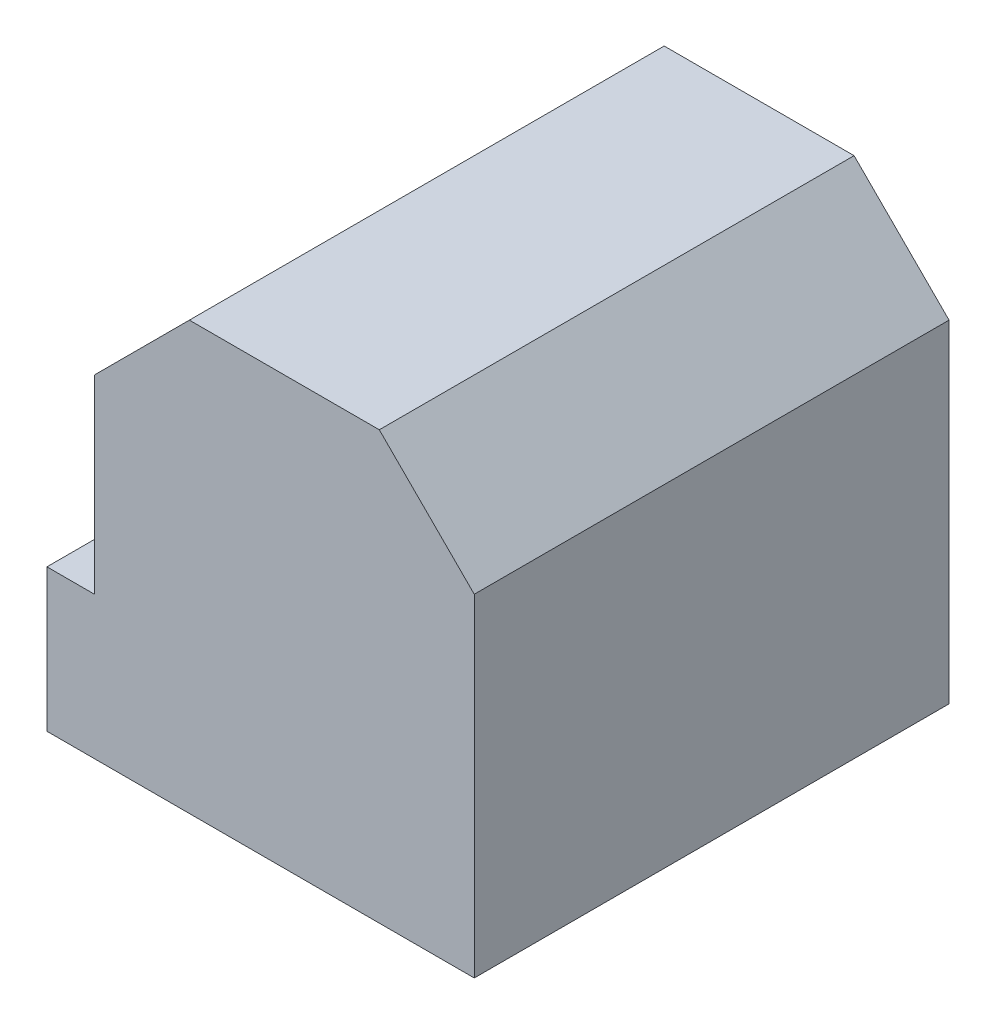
from build123d import *

# Parameters (mm, degrees)
BASE_EXTRUSION_DEPTH        = 25
BASE_EXTRUSION_DEPTH_BACK   = 25
TROU_TARAUD_M12X1_751_D     = 10.2
TROU_TARAUD_M12X1_751_DEPTH = 26.75
TROU_TARAUD_M12X1_751_TIP   = 3.064389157


with BuildPart() as part:
    # Esquisse1 → Base-Extrusion (new, two sides: drawn at the far end of the back side and taken through both)
    with BuildSketch(Plane.XY.offset(-BASE_EXTRUSION_DEPTH_BACK)):
        Polygon((0, 15), (5, 15), (5, 35), (15, 45), (35, 45), (45, 35), (45, 0), (0, 0), align=None)
    extrude(amount=BASE_EXTRUSION_DEPTH + BASE_EXTRUSION_DEPTH_BACK)

    # Trou taraud_ M12x1.751
    with Locations(Plane.XZ):
        with Locations((25, 0)):
            Hole(TROU_TARAUD_M12X1_751_D / 2, depth=TROU_TARAUD_M12X1_751_DEPTH)
            with Locations((0, 0, -(TROU_TARAUD_M12X1_751_DEPTH + TROU_TARAUD_M12X1_751_TIP / 2))):  # 118° drill point
                Cone(0, TROU_TARAUD_M12X1_751_D / 2, TROU_TARAUD_M12X1_751_TIP, mode=Mode.SUBTRACT)


solid = part.part
